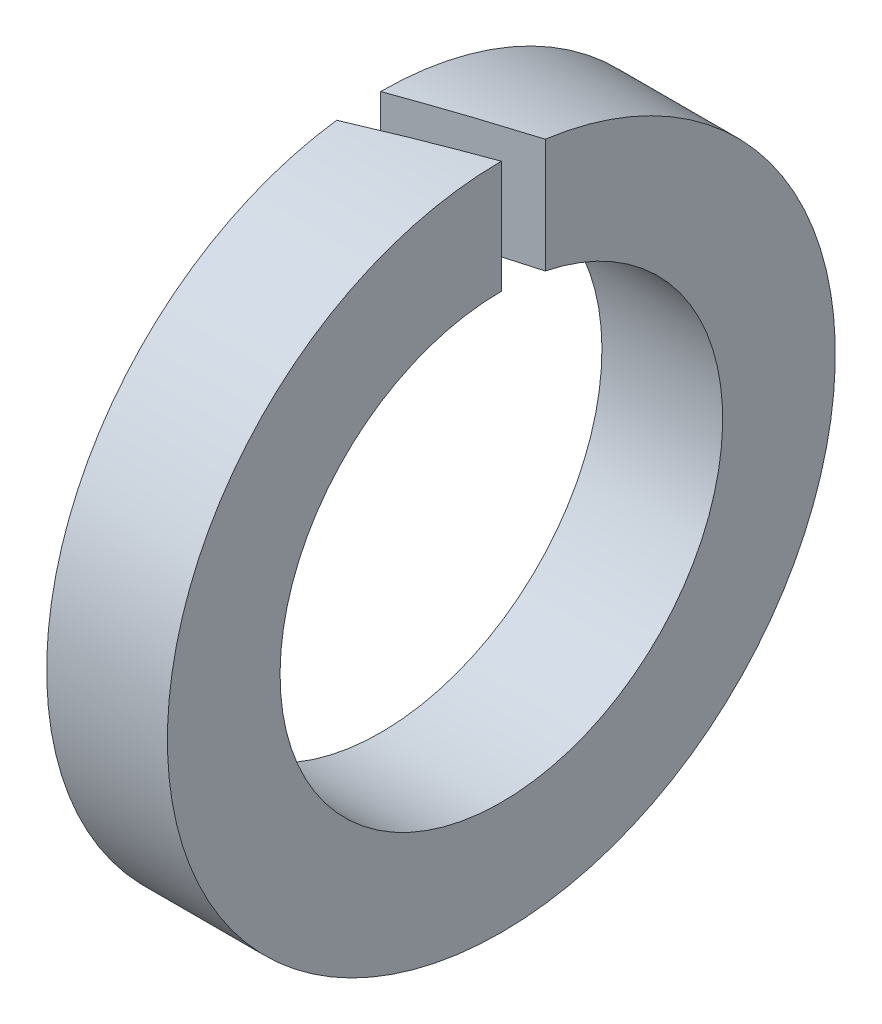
from build123d import *

# Parameters (mm, degrees)
ESQUISSE1_W             = 1.5
ESQUISSE1_H             = 1.4
ENL_V_MAT_EXTRU_1_DEPTH = 7.057639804


with BuildPart() as part:
    # Esquisse1 → Base-R_volution (revolve)
    with BuildSketch(Plane(origin=(0, 0, 0), x_dir=(1, 0, 0), z_dir=(0, 1, 0)), mode=Mode.PRIVATE) as base_r_volution_sk:
        with Locations((0.75, 3.45)):
            Rectangle(ESQUISSE1_W, ESQUISSE1_H)
    revolve(base_r_volution_sk.sketch.rotate(Axis((0, 0, 0), (1, 0, 0)), 180), axis=Axis((0, 0, 0), (1, 0, 0)))

    # Esquisse2 → Enl_v. mat.-Extru.1 (cut, through all)
    with BuildSketch(Plane(origin=(0, 0, 0), x_dir=(1, 0, 0), z_dir=(0, 1, 0))):
        Polygon((0, 0), (1.5, 0.545955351), (1.5, 0), (0, -0.545955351), align=None)
    extrude(amount=ENL_V_MAT_EXTRU_1_DEPTH, mode=Mode.SUBTRACT)


solid = part.part
